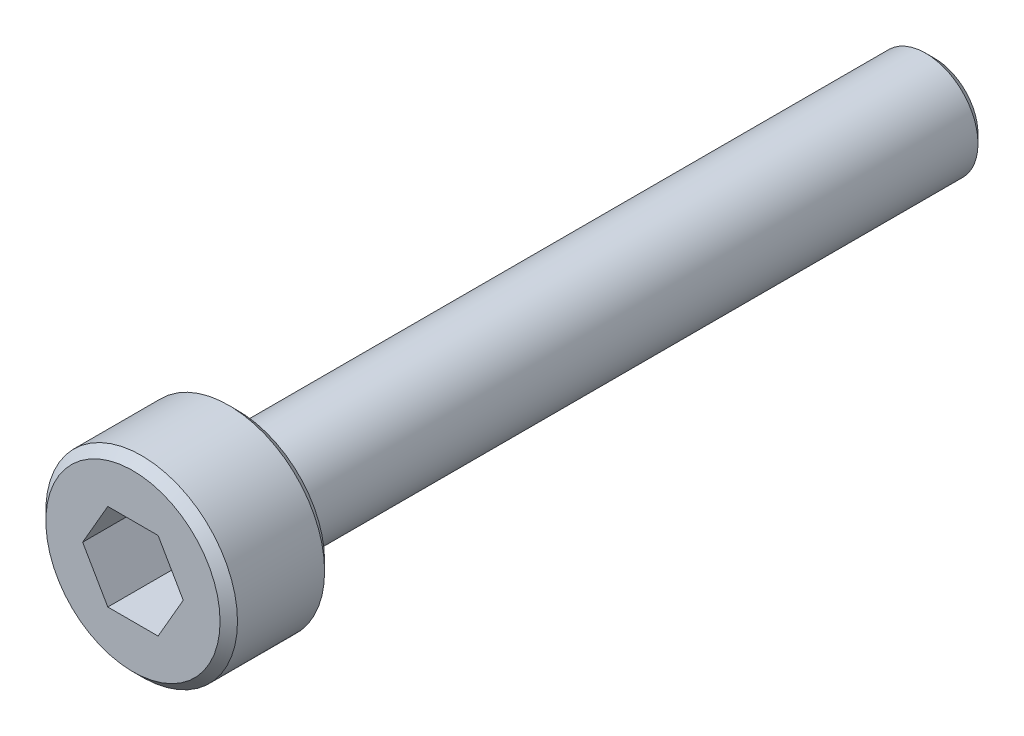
ISO-10303-21;
HEADER;
FILE_DESCRIPTION(('STEP AP214'),'2;1');
FILE_NAME('part.step','',(''),(''),'','','');
FILE_SCHEMA(('AUTOMOTIVE_DESIGN { 1 0 10303 214 1 1 1 1 }'));
ENDSEC;
DATA;
#1=APPLICATION_CONTEXT('core data for automotive mechanical design processes');
#2=APPLICATION_PROTOCOL_DEFINITION('international standard','automotive_design',2000,#1);
#3=PRODUCT_CONTEXT('',#1,'mechanical');
#4=PRODUCT('Part','Part','',(#3));
#5=PRODUCT_RELATED_PRODUCT_CATEGORY('part','',(#4));
#6=PRODUCT_DEFINITION_FORMATION('','',#4);
#7=PRODUCT_DEFINITION_CONTEXT('part definition',#1,'design');
#8=PRODUCT_DEFINITION('design','',#6,#7);
#9=PRODUCT_DEFINITION_SHAPE('','',#8);
#10=(LENGTH_UNIT() NAMED_UNIT(*) SI_UNIT(.MILLI.,.METRE.));
#11=(NAMED_UNIT(*) PLANE_ANGLE_UNIT() SI_UNIT($,.RADIAN.));
#12=(NAMED_UNIT(*) SI_UNIT($,.STERADIAN.) SOLID_ANGLE_UNIT());
#13=UNCERTAINTY_MEASURE_WITH_UNIT(LENGTH_MEASURE(1.E-05),#10,'distance_accuracy_value','');
#14=(GEOMETRIC_REPRESENTATION_CONTEXT(3) GLOBAL_UNCERTAINTY_ASSIGNED_CONTEXT((#13)) GLOBAL_UNIT_ASSIGNED_CONTEXT((#10,
#11,#12)) REPRESENTATION_CONTEXT('',''));
#15=CARTESIAN_POINT('',(0.,0.,0.));
#16=DIRECTION('',(0.,0.,1.));
#17=DIRECTION('',(1.,0.,0.));
#18=AXIS2_PLACEMENT_3D('',#15,#16,#17);
#19=CARTESIAN_POINT('',(0.,0.,20.));
#20=DIRECTION('',(0.,0.,-1.));
#21=DIRECTION('',(-1.,0.,0.));
#22=AXIS2_PLACEMENT_3D('',#19,#20,#21);
#23=CYLINDRICAL_SURFACE('',#22,1.5);
#24=CARTESIAN_POINT('',(0.,0.,0.249999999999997));
#25=DIRECTION('',(0.,0.,1.));
#26=DIRECTION('',(1.,0.,0.));
#27=AXIS2_PLACEMENT_3D('',#24,#25,#26);
#28=CIRCLE('',#27,1.5);
#29=CARTESIAN_POINT('',(1.5,0.,0.249999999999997));
#30=VERTEX_POINT('',#29);
#31=EDGE_CURVE('E189',#30,#30,#28,.T.);
#32=ORIENTED_EDGE('',*,*,#31,.T.);
#33=EDGE_LOOP('',(#32));
#34=FACE_BOUND('',#33,.T.);
#35=CARTESIAN_POINT('',(0.,0.,20.));
#36=DIRECTION('',(0.,0.,1.));
#37=DIRECTION('',(1.,0.,0.));
#38=AXIS2_PLACEMENT_3D('',#35,#36,#37);
#39=CIRCLE('',#38,1.5);
#40=CARTESIAN_POINT('',(1.5,0.,20.));
#41=VERTEX_POINT('',#40);
#42=EDGE_CURVE('E164',#41,#41,#39,.T.);
#43=ORIENTED_EDGE('',*,*,#42,.F.);
#44=EDGE_LOOP('',(#43));
#45=FACE_BOUND('',#44,.T.);
#46=ADVANCED_FACE('F47',(#34,#45),#23,.T.);
#47=CARTESIAN_POINT('',(0.,0.,0.));
#48=DIRECTION('',(0.,0.,1.));
#49=DIRECTION('',(1.,0.,0.));
#50=AXIS2_PLACEMENT_3D('',#47,#48,#49);
#51=PLANE('',#50);
#52=CARTESIAN_POINT('',(0.,0.,0.));
#53=DIRECTION('',(0.,0.,1.));
#54=DIRECTION('',(1.,0.,0.));
#55=AXIS2_PLACEMENT_3D('',#52,#53,#54);
#56=CIRCLE('',#55,1.25);
#57=CARTESIAN_POINT('',(1.25,0.,0.));
#58=VERTEX_POINT('',#57);
#59=EDGE_CURVE('E56',#58,#58,#56,.F.);
#60=ORIENTED_EDGE('',*,*,#59,.T.);
#61=EDGE_LOOP('',(#60));
#62=FACE_BOUND('',#61,.T.);
#63=ADVANCED_FACE('F197',(#62),#51,.F.);
#64=CARTESIAN_POINT('',(0.,0.,23.));
#65=DIRECTION('',(0.,0.,-1.));
#66=DIRECTION('',(-1.,0.,0.));
#67=AXIS2_PLACEMENT_3D('',#64,#65,#66);
#68=CYLINDRICAL_SURFACE('',#67,2.75);
#69=CARTESIAN_POINT('',(0.,0.,20.25));
#70=DIRECTION('',(0.,0.,1.));
#71=DIRECTION('',(1.,0.,0.));
#72=AXIS2_PLACEMENT_3D('',#69,#70,#71);
#73=CIRCLE('',#72,2.75);
#74=CARTESIAN_POINT('',(2.75,0.,20.25));
#75=VERTEX_POINT('',#74);
#76=EDGE_CURVE('E185',#75,#75,#73,.T.);
#77=ORIENTED_EDGE('',*,*,#76,.T.);
#78=EDGE_LOOP('',(#77));
#79=FACE_BOUND('',#78,.T.);
#80=CARTESIAN_POINT('',(0.,0.,22.75));
#81=DIRECTION('',(0.,0.,1.));
#82=DIRECTION('',(1.,0.,0.));
#83=AXIS2_PLACEMENT_3D('',#80,#81,#82);
#84=CIRCLE('',#83,2.75);
#85=CARTESIAN_POINT('',(2.75,0.,22.75));
#86=VERTEX_POINT('',#85);
#87=EDGE_CURVE('E177',#86,#86,#84,.F.);
#88=ORIENTED_EDGE('',*,*,#87,.T.);
#89=EDGE_LOOP('',(#88));
#90=FACE_BOUND('',#89,.T.);
#91=ADVANCED_FACE('F225',(#79,#90),#68,.T.);
#92=CARTESIAN_POINT('',(0.,0.,23.));
#93=DIRECTION('',(0.,0.,1.));
#94=DIRECTION('',(1.,0.,0.));
#95=AXIS2_PLACEMENT_3D('',#92,#93,#94);
#96=PLANE('',#95);
#97=DIRECTION('',(0.5,0.866025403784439,0.));
#98=VECTOR('',#97,1.);
#99=CARTESIAN_POINT('',(0.721687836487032,-1.25,23.));
#100=LINE('',#99,#98);
#101=CARTESIAN_POINT('',(0.721687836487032,-1.25,23.));
#102=VERTEX_POINT('',#101);
#103=CARTESIAN_POINT('',(1.44337567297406,0.,23.));
#104=VERTEX_POINT('',#103);
#105=EDGE_CURVE('E68',#102,#104,#100,.T.);
#106=ORIENTED_EDGE('',*,*,#105,.F.);
#107=DIRECTION('',(1.,0.,0.));
#108=VECTOR('',#107,1.);
#109=CARTESIAN_POINT('',(-0.721687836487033,-1.25,23.));
#110=LINE('',#109,#108);
#111=CARTESIAN_POINT('',(-0.721687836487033,-1.25,23.));
#112=VERTEX_POINT('',#111);
#113=EDGE_CURVE('E157',#112,#102,#110,.T.);
#114=ORIENTED_EDGE('',*,*,#113,.F.);
#115=DIRECTION('',(0.5,-0.866025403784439,0.));
#116=VECTOR('',#115,1.);
#117=CARTESIAN_POINT('',(-1.44337567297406,0.,23.));
#118=LINE('',#117,#116);
#119=CARTESIAN_POINT('',(-1.44337567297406,0.,23.));
#120=VERTEX_POINT('',#119);
#121=EDGE_CURVE('E156',#120,#112,#118,.T.);
#122=ORIENTED_EDGE('',*,*,#121,.F.);
#123=DIRECTION('',(-0.5,-0.866025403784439,0.));
#124=VECTOR('',#123,1.);
#125=CARTESIAN_POINT('',(-0.721687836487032,1.25,23.));
#126=LINE('',#125,#124);
#127=CARTESIAN_POINT('',(-0.721687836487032,1.25,23.));
#128=VERTEX_POINT('',#127);
#129=EDGE_CURVE('E111',#128,#120,#126,.T.);
#130=ORIENTED_EDGE('',*,*,#129,.F.);
#131=DIRECTION('',(-1.,0.,0.));
#132=VECTOR('',#131,1.);
#133=CARTESIAN_POINT('',(0.721687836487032,1.25,23.));
#134=LINE('',#133,#132);
#135=CARTESIAN_POINT('',(0.721687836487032,1.25,23.));
#136=VERTEX_POINT('',#135);
#137=EDGE_CURVE('E147',#136,#128,#134,.T.);
#138=ORIENTED_EDGE('',*,*,#137,.F.);
#139=DIRECTION('',(-0.5,0.866025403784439,0.));
#140=VECTOR('',#139,1.);
#141=CARTESIAN_POINT('',(1.44337567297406,0.,23.));
#142=LINE('',#141,#140);
#143=EDGE_CURVE('E148',#104,#136,#142,.T.);
#144=ORIENTED_EDGE('',*,*,#143,.F.);
#145=EDGE_LOOP('',(#106,#114,#122,#130,#138,#144));
#146=FACE_BOUND('',#145,.T.);
#147=CARTESIAN_POINT('',(0.,0.,23.));
#148=DIRECTION('',(0.,0.,1.));
#149=DIRECTION('',(1.,0.,0.));
#150=AXIS2_PLACEMENT_3D('',#147,#148,#149);
#151=CIRCLE('',#150,2.5);
#152=CARTESIAN_POINT('',(2.5,0.,23.));
#153=VERTEX_POINT('',#152);
#154=EDGE_CURVE('E11',#153,#153,#151,.T.);
#155=ORIENTED_EDGE('',*,*,#154,.T.);
#156=EDGE_LOOP('',(#155));
#157=FACE_BOUND('',#156,.T.);
#158=ADVANCED_FACE('F215',(#146,#157),#96,.T.);
#159=CARTESIAN_POINT('',(0.,0.,20.));
#160=DIRECTION('',(0.,0.,1.));
#161=DIRECTION('',(1.,0.,0.));
#162=AXIS2_PLACEMENT_3D('',#159,#160,#161);
#163=PLANE('',#162);
#164=CARTESIAN_POINT('',(0.,0.,20.));
#165=DIRECTION('',(0.,0.,1.));
#166=DIRECTION('',(1.,0.,0.));
#167=AXIS2_PLACEMENT_3D('',#164,#165,#166);
#168=CIRCLE('',#167,2.5);
#169=CARTESIAN_POINT('',(2.5,0.,20.));
#170=VERTEX_POINT('',#169);
#171=EDGE_CURVE('E188',#170,#170,#168,.F.);
#172=ORIENTED_EDGE('',*,*,#171,.T.);
#173=EDGE_LOOP('',(#172));
#174=FACE_BOUND('',#173,.T.);
#175=ORIENTED_EDGE('',*,*,#42,.T.);
#176=EDGE_LOOP('',(#175));
#177=FACE_BOUND('',#176,.T.);
#178=ADVANCED_FACE('F209',(#174,#177),#163,.F.);
#179=CARTESIAN_POINT('',(0.,0.,20.25));
#180=DIRECTION('',(0.,0.,1.));
#181=DIRECTION('',(1.,0.,0.));
#182=AXIS2_PLACEMENT_3D('',#179,#180,#181);
#183=CONICAL_SURFACE('',#182,2.75,0.785398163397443);
#184=ORIENTED_EDGE('',*,*,#171,.F.);
#185=EDGE_LOOP('',(#184));
#186=FACE_BOUND('',#185,.T.);
#187=ORIENTED_EDGE('',*,*,#76,.F.);
#188=EDGE_LOOP('',(#187));
#189=FACE_BOUND('',#188,.T.);
#190=ADVANCED_FACE('F205',(#186,#189),#183,.T.);
#191=CARTESIAN_POINT('',(0.,0.,0.249999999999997));
#192=DIRECTION('',(0.,0.,1.));
#193=DIRECTION('',(1.,0.,0.));
#194=AXIS2_PLACEMENT_3D('',#191,#192,#193);
#195=CONICAL_SURFACE('',#194,1.5,0.785398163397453);
#196=ORIENTED_EDGE('',*,*,#59,.F.);
#197=EDGE_LOOP('',(#196));
#198=FACE_BOUND('',#197,.T.);
#199=ORIENTED_EDGE('',*,*,#31,.F.);
#200=EDGE_LOOP('',(#199));
#201=FACE_BOUND('',#200,.T.);
#202=ADVANCED_FACE('F200',(#198,#201),#195,.T.);
#203=CARTESIAN_POINT('',(0.,0.,23.));
#204=DIRECTION('',(0.,0.,-1.));
#205=DIRECTION('',(-1.,0.,0.));
#206=AXIS2_PLACEMENT_3D('',#203,#204,#205);
#207=CONICAL_SURFACE('',#206,2.5,0.78539816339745);
#208=ORIENTED_EDGE('',*,*,#87,.F.);
#209=EDGE_LOOP('',(#208));
#210=FACE_BOUND('',#209,.T.);
#211=ORIENTED_EDGE('',*,*,#154,.F.);
#212=EDGE_LOOP('',(#211));
#213=FACE_BOUND('',#212,.T.);
#214=ADVANCED_FACE('F55',(#210,#213),#207,.T.);
#215=CARTESIAN_POINT('',(0.721687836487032,-1.25,21.));
#216=DIRECTION('',(0.866025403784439,-0.5,0.));
#217=DIRECTION('',(0.5,0.866025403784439,0.));
#218=AXIS2_PLACEMENT_3D('',#215,#216,#217);
#219=PLANE('',#218);
#220=ORIENTED_EDGE('',*,*,#105,.T.);
#221=DIRECTION('',(0.,0.,1.));
#222=VECTOR('',#221,1.);
#223=CARTESIAN_POINT('',(1.44337567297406,0.,21.));
#224=LINE('',#223,#222);
#225=CARTESIAN_POINT('',(1.44337567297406,0.,21.));
#226=VERTEX_POINT('',#225);
#227=EDGE_CURVE('E96',#226,#104,#224,.T.);
#228=ORIENTED_EDGE('',*,*,#227,.F.);
#229=DIRECTION('',(0.5,0.866025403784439,0.));
#230=VECTOR('',#229,1.);
#231=CARTESIAN_POINT('',(0.721687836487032,-1.25,21.));
#232=LINE('',#231,#230);
#233=CARTESIAN_POINT('',(0.721687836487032,-1.25,21.));
#234=VERTEX_POINT('',#233);
#235=EDGE_CURVE('E165',#234,#226,#232,.T.);
#236=ORIENTED_EDGE('',*,*,#235,.F.);
#237=DIRECTION('',(0.,0.,1.));
#238=VECTOR('',#237,1.);
#239=CARTESIAN_POINT('',(0.721687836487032,-1.25,21.));
#240=LINE('',#239,#238);
#241=EDGE_CURVE('E74',#234,#102,#240,.T.);
#242=ORIENTED_EDGE('',*,*,#241,.T.);
#243=EDGE_LOOP('',(#220,#228,#236,#242));
#244=FACE_BOUND('',#243,.T.);
#245=ADVANCED_FACE('F278',(#244),#219,.F.);
#246=CARTESIAN_POINT('',(-0.721687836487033,-1.25,21.));
#247=DIRECTION('',(0.,-1.,0.));
#248=DIRECTION('',(1.,0.,0.));
#249=AXIS2_PLACEMENT_3D('',#246,#247,#248);
#250=PLANE('',#249);
#251=ORIENTED_EDGE('',*,*,#113,.T.);
#252=ORIENTED_EDGE('',*,*,#241,.F.);
#253=DIRECTION('',(1.,0.,0.));
#254=VECTOR('',#253,1.);
#255=CARTESIAN_POINT('',(-0.721687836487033,-1.25,21.));
#256=LINE('',#255,#254);
#257=CARTESIAN_POINT('',(-0.721687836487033,-1.25,21.));
#258=VERTEX_POINT('',#257);
#259=EDGE_CURVE('E126',#258,#234,#256,.T.);
#260=ORIENTED_EDGE('',*,*,#259,.F.);
#261=DIRECTION('',(0.,0.,1.));
#262=VECTOR('',#261,1.);
#263=CARTESIAN_POINT('',(-0.721687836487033,-1.25,21.));
#264=LINE('',#263,#262);
#265=EDGE_CURVE('E117',#258,#112,#264,.T.);
#266=ORIENTED_EDGE('',*,*,#265,.T.);
#267=EDGE_LOOP('',(#251,#252,#260,#266));
#268=FACE_BOUND('',#267,.T.);
#269=ADVANCED_FACE('F287',(#268),#250,.F.);
#270=CARTESIAN_POINT('',(-1.44337567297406,0.,21.));
#271=DIRECTION('',(-0.866025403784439,-0.5,0.));
#272=DIRECTION('',(0.5,-0.866025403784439,0.));
#273=AXIS2_PLACEMENT_3D('',#270,#271,#272);
#274=PLANE('',#273);
#275=ORIENTED_EDGE('',*,*,#121,.T.);
#276=ORIENTED_EDGE('',*,*,#265,.F.);
#277=DIRECTION('',(0.5,-0.866025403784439,0.));
#278=VECTOR('',#277,1.);
#279=CARTESIAN_POINT('',(-1.44337567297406,0.,21.));
#280=LINE('',#279,#278);
#281=CARTESIAN_POINT('',(-1.44337567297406,0.,21.));
#282=VERTEX_POINT('',#281);
#283=EDGE_CURVE('E122',#282,#258,#280,.T.);
#284=ORIENTED_EDGE('',*,*,#283,.F.);
#285=DIRECTION('',(0.,0.,1.));
#286=VECTOR('',#285,1.);
#287=CARTESIAN_POINT('',(-1.44337567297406,0.,21.));
#288=LINE('',#287,#286);
#289=EDGE_CURVE('E110',#282,#120,#288,.T.);
#290=ORIENTED_EDGE('',*,*,#289,.T.);
#291=EDGE_LOOP('',(#275,#276,#284,#290));
#292=FACE_BOUND('',#291,.T.);
#293=ADVANCED_FACE('F125',(#292),#274,.F.);
#294=CARTESIAN_POINT('',(-0.721687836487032,1.25,21.));
#295=DIRECTION('',(-0.866025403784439,0.5,0.));
#296=DIRECTION('',(-0.5,-0.866025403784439,0.));
#297=AXIS2_PLACEMENT_3D('',#294,#295,#296);
#298=PLANE('',#297);
#299=ORIENTED_EDGE('',*,*,#129,.T.);
#300=ORIENTED_EDGE('',*,*,#289,.F.);
#301=DIRECTION('',(-0.5,-0.866025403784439,0.));
#302=VECTOR('',#301,1.);
#303=CARTESIAN_POINT('',(-0.721687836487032,1.25,21.));
#304=LINE('',#303,#302);
#305=CARTESIAN_POINT('',(-0.721687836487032,1.25,21.));
#306=VERTEX_POINT('',#305);
#307=EDGE_CURVE('E112',#306,#282,#304,.T.);
#308=ORIENTED_EDGE('',*,*,#307,.F.);
#309=DIRECTION('',(0.,0.,1.));
#310=VECTOR('',#309,1.);
#311=CARTESIAN_POINT('',(-0.721687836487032,1.25,21.));
#312=LINE('',#311,#310);
#313=EDGE_CURVE('E119',#306,#128,#312,.T.);
#314=ORIENTED_EDGE('',*,*,#313,.T.);
#315=EDGE_LOOP('',(#299,#300,#308,#314));
#316=FACE_BOUND('',#315,.T.);
#317=ADVANCED_FACE('F108',(#316),#298,.F.);
#318=CARTESIAN_POINT('',(0.721687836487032,1.25,21.));
#319=DIRECTION('',(0.,1.,0.));
#320=DIRECTION('',(-1.,0.,0.));
#321=AXIS2_PLACEMENT_3D('',#318,#319,#320);
#322=PLANE('',#321);
#323=ORIENTED_EDGE('',*,*,#137,.T.);
#324=ORIENTED_EDGE('',*,*,#313,.F.);
#325=DIRECTION('',(-1.,0.,0.));
#326=VECTOR('',#325,1.);
#327=CARTESIAN_POINT('',(0.721687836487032,1.25,21.));
#328=LINE('',#327,#326);
#329=CARTESIAN_POINT('',(0.721687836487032,1.25,21.));
#330=VERTEX_POINT('',#329);
#331=EDGE_CURVE('E132',#330,#306,#328,.T.);
#332=ORIENTED_EDGE('',*,*,#331,.F.);
#333=DIRECTION('',(0.,0.,1.));
#334=VECTOR('',#333,1.);
#335=CARTESIAN_POINT('',(0.721687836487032,1.25,21.));
#336=LINE('',#335,#334);
#337=EDGE_CURVE('E168',#330,#136,#336,.T.);
#338=ORIENTED_EDGE('',*,*,#337,.T.);
#339=EDGE_LOOP('',(#323,#324,#332,#338));
#340=FACE_BOUND('',#339,.T.);
#341=ADVANCED_FACE('F315',(#340),#322,.F.);
#342=CARTESIAN_POINT('',(1.44337567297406,0.,21.));
#343=DIRECTION('',(0.866025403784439,0.5,0.));
#344=DIRECTION('',(-0.5,0.866025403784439,0.));
#345=AXIS2_PLACEMENT_3D('',#342,#343,#344);
#346=PLANE('',#345);
#347=ORIENTED_EDGE('',*,*,#143,.T.);
#348=ORIENTED_EDGE('',*,*,#337,.F.);
#349=DIRECTION('',(-0.5,0.866025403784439,0.));
#350=VECTOR('',#349,1.);
#351=CARTESIAN_POINT('',(1.44337567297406,0.,21.));
#352=LINE('',#351,#350);
#353=EDGE_CURVE('E137',#226,#330,#352,.T.);
#354=ORIENTED_EDGE('',*,*,#353,.F.);
#355=ORIENTED_EDGE('',*,*,#227,.T.);
#356=EDGE_LOOP('',(#347,#348,#354,#355));
#357=FACE_BOUND('',#356,.T.);
#358=ADVANCED_FACE('F321',(#357),#346,.F.);
#359=CARTESIAN_POINT('',(0.,0.,21.));
#360=DIRECTION('',(0.,0.,1.));
#361=DIRECTION('',(1.,0.,0.));
#362=AXIS2_PLACEMENT_3D('',#359,#360,#361);
#363=PLANE('',#362);
#364=ORIENTED_EDGE('',*,*,#235,.T.);
#365=ORIENTED_EDGE('',*,*,#353,.T.);
#366=ORIENTED_EDGE('',*,*,#331,.T.);
#367=ORIENTED_EDGE('',*,*,#307,.T.);
#368=ORIENTED_EDGE('',*,*,#283,.T.);
#369=ORIENTED_EDGE('',*,*,#259,.T.);
#370=EDGE_LOOP('',(#364,#365,#366,#367,#368,#369));
#371=FACE_BOUND('',#370,.T.);
#372=ADVANCED_FACE('F133',(#371),#363,.T.);
#373=CLOSED_SHELL('',(#46,#63,#91,#158,#178,#190,#202,#214,#245,#269,#293,#317,#341,#358,#372));
#374=MANIFOLD_SOLID_BREP('B2',#373);
#375=ADVANCED_BREP_SHAPE_REPRESENTATION('',(#18,#374),#14);
#376=SHAPE_DEFINITION_REPRESENTATION(#9,#375);
ENDSEC;
END-ISO-10303-21;
